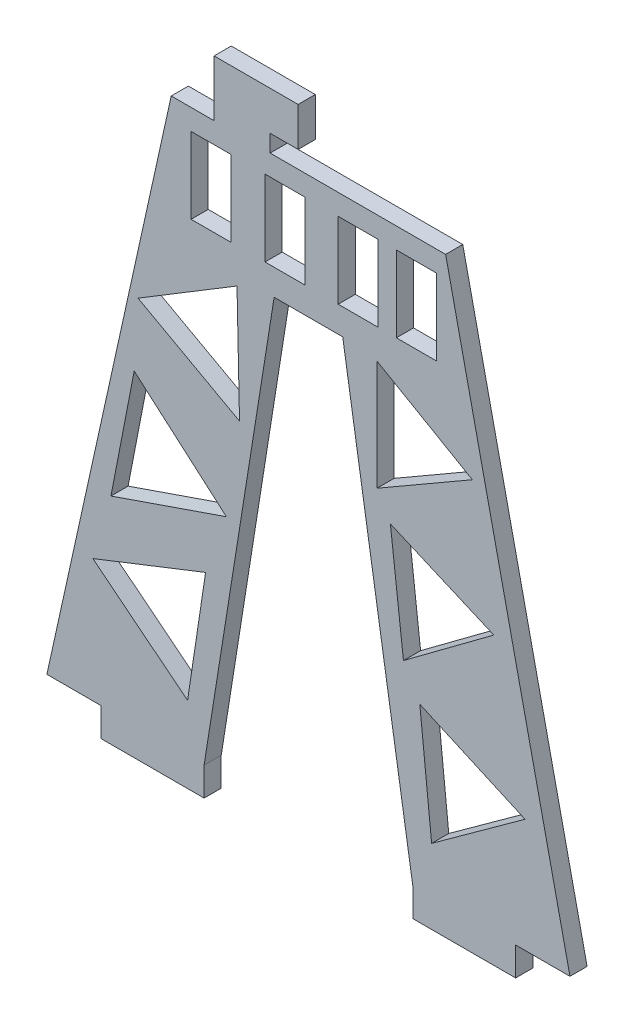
from build123d import *

# Parameters (mm, degrees)
SKETCH1_W           = 7
SKETCH1_H           = 13.314290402
SKETCH1_W_2         = 18
SKETCH1_H_2         = 5
BOSS_EXTRUDE1_DEPTH = 3


with BuildPart() as part:
    # Sketch1 → Boss-Extrude1 (new body)
    # profile 1 of 4: a face of its own
    with BuildSketch(Plane.XY):
        Polygon((-24, 98.5), (-45.75, 0), (-36.25, 0), (-18.25, 0), (-6, 77), (6, 77), (18.25, 0), (36.25, 0), (45.75, 0), (24, 98.5), (-6.7, 98.5), (-16.5, 98.5), align=None)
        Polygon((-21.136125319, 8.359045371), (-37.715544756, 21.561452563), (-17.992215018, 29.318447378), align=None, mode=Mode.SUBTRACT)
        Polygon((-30.476122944, 53.58871546), (-14.350581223, 39.580270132), (-34.545021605, 32.619364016), align=None, mode=Mode.SUBTRACT)
        Polygon((21.551534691, 8.045407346), (19.481749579, 28.09940984), (37.883917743, 19.864895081), align=None, mode=Mode.SUBTRACT)
        Polygon((16.622559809, 33.278786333), (14.33860486, 52.844202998), (32.424730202, 45.039457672), align=None, mode=Mode.SUBTRACT)
        Polygon((-12.491352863, 75.462554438), (-12.056170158, 55.213398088), (-29.810045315, 64.961096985), align=None, mode=Mode.SUBTRACT)
        with Locations((-17.024510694, 88.209062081)):
            Rectangle(SKETCH1_W, SKETCH1_H, mode=Mode.SUBTRACT)
        with Locations((-4.094286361, 88.209062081)):
            Rectangle(SKETCH1_W, SKETCH1_H, mode=Mode.SUBTRACT)
        Polygon((11.992994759, 57.067998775), (11.992994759, 76.328534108), (28.673107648, 66.698266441), align=None, mode=Mode.SUBTRACT)
        with Locations((8.70791595, 88.209062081)):
            Rectangle(SKETCH1_W, SKETCH1_H, mode=Mode.SUBTRACT)
        with Locations((18.885666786, 88.209062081)):
            Rectangle(SKETCH1_W, SKETCH1_H, mode=Mode.SUBTRACT)
    # profile 2 of 4: a face of its own
    with BuildSketch(Plane.XY):
        with Locations((-27.25, -2.5)):
            Rectangle(SKETCH1_W_2, SKETCH1_H_2)
    # profile 3 of 4: a face of its own
    with BuildSketch(Plane.XY):
        Polygon((-16.5, 108.3179103), (-16.5, 98.5), (-6.7, 98.5), (-6.7, 101.5), (-1.8, 101.5), (-1.8, 108.3179103), (-6.7, 108.3179103), align=None)
    # profile 4 of 4: a face of its own
    with BuildSketch(Plane.XY):
        with Locations((27.25, -2.5)):
            Rectangle(SKETCH1_W_2, SKETCH1_H_2)
    extrude(amount=BOSS_EXTRUDE1_DEPTH)


solid = part.part
